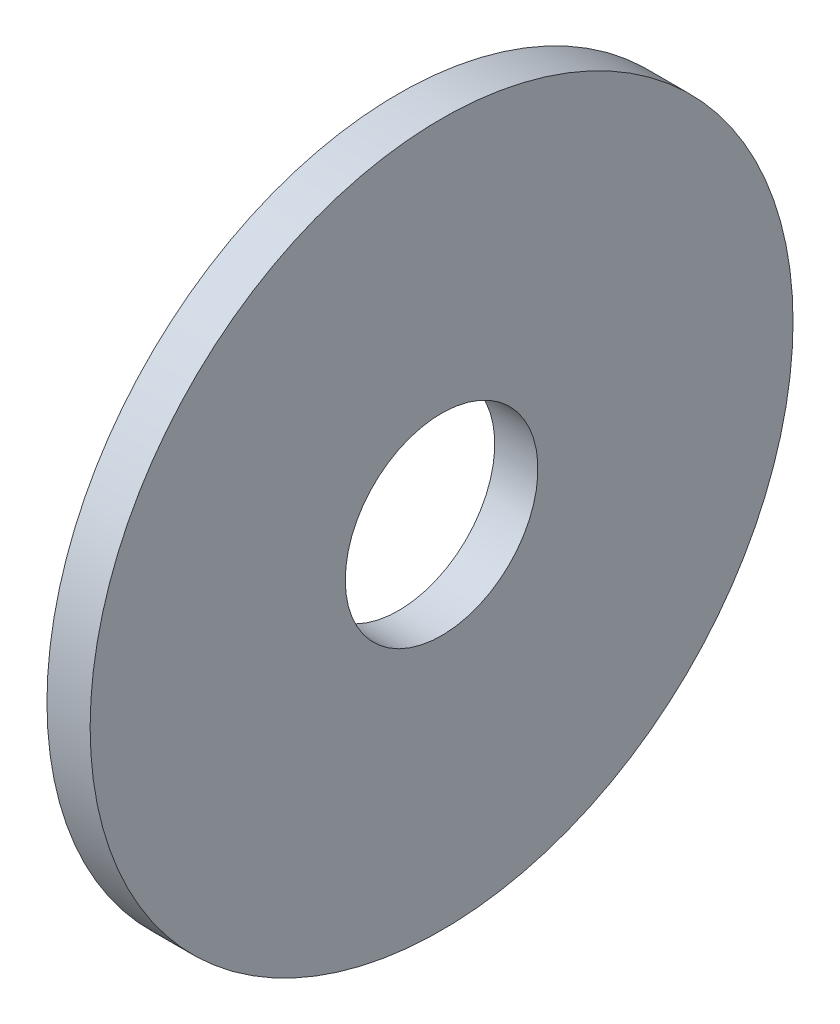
from build123d import *

# Parameters (mm, degrees)
SKETCH1_W = 6.0452
SKETCH1_H = 35.7251


with BuildPart() as part:
    # Sketch1 → Base-Revolve (revolve)
    with BuildSketch(Plane.XY, mode=Mode.PRIVATE) as base_revolve_sk:
        with Locations((-3.0226, 31.34995)):
            Rectangle(SKETCH1_W, SKETCH1_H)
    revolve(base_revolve_sk.sketch.rotate(Axis((-34.925, 0, 0), (1, 0, 0)), 90), axis=Axis((-34.925, 0, 0), (1, 0, 0)))


solid = part.part
